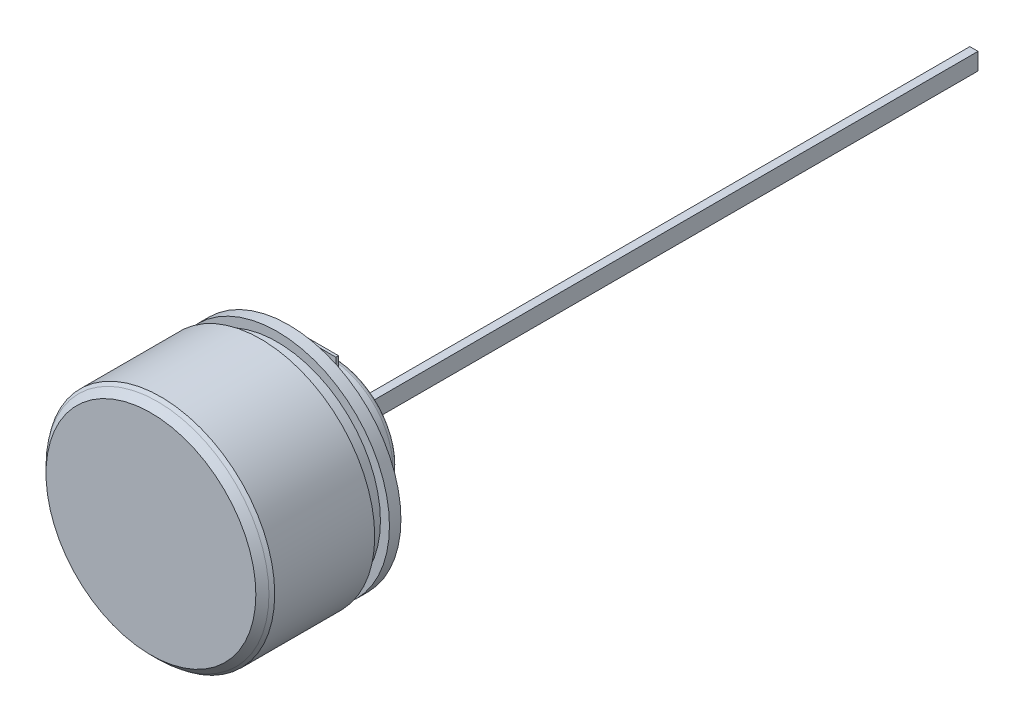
ISO-10303-21;
HEADER;
FILE_DESCRIPTION(('STEP AP214'),'2;1');
FILE_NAME('part.step','',(''),(''),'','','');
FILE_SCHEMA(('AUTOMOTIVE_DESIGN { 1 0 10303 214 1 1 1 1 }'));
ENDSEC;
DATA;
#1=APPLICATION_CONTEXT('core data for automotive mechanical design processes');
#2=APPLICATION_PROTOCOL_DEFINITION('international standard','automotive_design',2000,#1);
#3=PRODUCT_CONTEXT('',#1,'mechanical');
#4=PRODUCT('Part','Part','',(#3));
#5=PRODUCT_RELATED_PRODUCT_CATEGORY('part','',(#4));
#6=PRODUCT_DEFINITION_FORMATION('','',#4);
#7=PRODUCT_DEFINITION_CONTEXT('part definition',#1,'design');
#8=PRODUCT_DEFINITION('design','',#6,#7);
#9=PRODUCT_DEFINITION_SHAPE('','',#8);
#10=(LENGTH_UNIT() NAMED_UNIT(*) SI_UNIT(.MILLI.,.METRE.));
#11=(NAMED_UNIT(*) PLANE_ANGLE_UNIT() SI_UNIT($,.RADIAN.));
#12=(NAMED_UNIT(*) SI_UNIT($,.STERADIAN.) SOLID_ANGLE_UNIT());
#13=UNCERTAINTY_MEASURE_WITH_UNIT(LENGTH_MEASURE(1.E-05),#10,'distance_accuracy_value','');
#14=(GEOMETRIC_REPRESENTATION_CONTEXT(3) GLOBAL_UNCERTAINTY_ASSIGNED_CONTEXT((#13)) GLOBAL_UNIT_ASSIGNED_CONTEXT((#10,
#11,#12)) REPRESENTATION_CONTEXT('',''));
#15=CARTESIAN_POINT('',(0.,0.,0.));
#16=DIRECTION('',(0.,0.,1.));
#17=DIRECTION('',(1.,0.,0.));
#18=AXIS2_PLACEMENT_3D('',#15,#16,#17);
#19=CARTESIAN_POINT('',(0.,19.25,0.));
#20=DIRECTION('',(0.,0.,1.));
#21=DIRECTION('',(1.,0.,0.));
#22=AXIS2_PLACEMENT_3D('',#19,#20,#21);
#23=PLANE('',#22);
#24=CARTESIAN_POINT('',(0.,0.,0.));
#25=DIRECTION('',(0.,0.,1.));
#26=DIRECTION('',(1.,0.,0.));
#27=AXIS2_PLACEMENT_3D('',#24,#25,#26);
#28=CIRCLE('',#27,27.75);
#29=CARTESIAN_POINT('',(27.75,0.,0.));
#30=VERTEX_POINT('',#29);
#31=EDGE_CURVE('E215',#30,#30,#28,.T.);
#32=ORIENTED_EDGE('',*,*,#31,.F.);
#33=EDGE_LOOP('',(#32));
#34=FACE_BOUND('',#33,.T.);
#35=CARTESIAN_POINT('',(0.,0.,0.));
#36=DIRECTION('',(0.,0.,1.));
#37=DIRECTION('',(1.,0.,0.));
#38=AXIS2_PLACEMENT_3D('',#35,#36,#37);
#39=CIRCLE('',#38,19.25);
#40=CARTESIAN_POINT('',(19.25,0.,0.));
#41=VERTEX_POINT('',#40);
#42=EDGE_CURVE('E176',#41,#41,#39,.T.);
#43=ORIENTED_EDGE('',*,*,#42,.T.);
#44=EDGE_LOOP('',(#43));
#45=FACE_BOUND('',#44,.T.);
#46=ADVANCED_FACE('F14',(#34,#45),#23,.F.);
#47=CARTESIAN_POINT('',(0.,0.,52.587904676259));
#48=DIRECTION('',(0.,0.,1.));
#49=DIRECTION('',(1.,0.,0.));
#50=AXIS2_PLACEMENT_3D('',#47,#48,#49);
#51=CYLINDRICAL_SURFACE('',#50,27.75);
#52=ORIENTED_EDGE('',*,*,#31,.T.);
#53=EDGE_LOOP('',(#52));
#54=FACE_BOUND('',#53,.T.);
#55=CARTESIAN_POINT('',(0.,0.,3.));
#56=DIRECTION('',(0.,0.,1.));
#57=DIRECTION('',(1.,0.,0.));
#58=AXIS2_PLACEMENT_3D('',#55,#56,#57);
#59=CIRCLE('',#58,27.75);
#60=CARTESIAN_POINT('',(27.75,0.,3.));
#61=VERTEX_POINT('',#60);
#62=EDGE_CURVE('E212',#61,#61,#59,.T.);
#63=ORIENTED_EDGE('',*,*,#62,.F.);
#64=EDGE_LOOP('',(#63));
#65=FACE_BOUND('',#64,.T.);
#66=ADVANCED_FACE('F273',(#54,#65),#51,.T.);
#67=CARTESIAN_POINT('',(0.,27.75,3.));
#68=DIRECTION('',(0.,0.,1.));
#69=DIRECTION('',(1.,0.,0.));
#70=AXIS2_PLACEMENT_3D('',#67,#68,#69);
#71=PLANE('',#70);
#72=CARTESIAN_POINT('',(0.,0.,3.));
#73=DIRECTION('',(0.,0.,1.));
#74=DIRECTION('',(1.,0.,0.));
#75=AXIS2_PLACEMENT_3D('',#72,#73,#74);
#76=CIRCLE('',#75,34.25);
#77=CARTESIAN_POINT('',(34.25,0.,3.));
#78=VERTEX_POINT('',#77);
#79=EDGE_CURVE('E209',#78,#78,#76,.T.);
#80=ORIENTED_EDGE('',*,*,#79,.F.);
#81=EDGE_LOOP('',(#80));
#82=FACE_BOUND('',#81,.T.);
#83=ORIENTED_EDGE('',*,*,#62,.T.);
#84=EDGE_LOOP('',(#83));
#85=FACE_BOUND('',#84,.T.);
#86=ADVANCED_FACE('F279',(#82,#85),#71,.F.);
#87=CARTESIAN_POINT('',(0.,0.,52.587904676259));
#88=DIRECTION('',(0.,0.,1.));
#89=DIRECTION('',(1.,0.,0.));
#90=AXIS2_PLACEMENT_3D('',#87,#88,#89);
#91=CYLINDRICAL_SURFACE('',#90,34.25);
#92=CARTESIAN_POINT('',(0.,0.,6.5));
#93=DIRECTION('',(0.,0.,1.));
#94=DIRECTION('',(1.,0.,0.));
#95=AXIS2_PLACEMENT_3D('',#92,#93,#94);
#96=CIRCLE('',#95,34.25);
#97=CARTESIAN_POINT('',(34.25,0.,6.5));
#98=VERTEX_POINT('',#97);
#99=EDGE_CURVE('E206',#98,#98,#96,.T.);
#100=ORIENTED_EDGE('',*,*,#99,.F.);
#101=EDGE_LOOP('',(#100));
#102=FACE_BOUND('',#101,.T.);
#103=ORIENTED_EDGE('',*,*,#79,.T.);
#104=EDGE_LOOP('',(#103));
#105=FACE_BOUND('',#104,.T.);
#106=ADVANCED_FACE('F335',(#102,#105),#91,.T.);
#107=CARTESIAN_POINT('',(0.,31.5,6.50000000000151));
#108=DIRECTION('',(0.,0.,1.));
#109=DIRECTION('',(1.,0.,0.));
#110=AXIS2_PLACEMENT_3D('',#107,#108,#109);
#111=PLANE('',#110);
#112=ORIENTED_EDGE('',*,*,#99,.T.);
#113=EDGE_LOOP('',(#112));
#114=FACE_BOUND('',#113,.T.);
#115=CARTESIAN_POINT('',(0.,0.,6.50000000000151));
#116=DIRECTION('',(0.,0.,1.));
#117=DIRECTION('',(1.,0.,0.));
#118=AXIS2_PLACEMENT_3D('',#115,#116,#117);
#119=CIRCLE('',#118,31.5);
#120=CARTESIAN_POINT('',(31.5,0.,6.50000000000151));
#121=VERTEX_POINT('',#120);
#122=EDGE_CURVE('E203',#121,#121,#119,.T.);
#123=ORIENTED_EDGE('',*,*,#122,.F.);
#124=EDGE_LOOP('',(#123));
#125=FACE_BOUND('',#124,.T.);
#126=ADVANCED_FACE('F331',(#114,#125),#111,.T.);
#127=CARTESIAN_POINT('',(0.,0.,52.587904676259));
#128=DIRECTION('',(0.,0.,1.));
#129=DIRECTION('',(1.,0.,0.));
#130=AXIS2_PLACEMENT_3D('',#127,#128,#129);
#131=CYLINDRICAL_SURFACE('',#130,31.5);
#132=ORIENTED_EDGE('',*,*,#122,.T.);
#133=EDGE_LOOP('',(#132));
#134=FACE_BOUND('',#133,.T.);
#135=CARTESIAN_POINT('',(0.,0.,11.500000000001));
#136=DIRECTION('',(0.,0.,1.));
#137=DIRECTION('',(1.,0.,0.));
#138=AXIS2_PLACEMENT_3D('',#135,#136,#137);
#139=CIRCLE('',#138,31.5);
#140=CARTESIAN_POINT('',(31.5,0.,11.500000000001));
#141=VERTEX_POINT('',#140);
#142=EDGE_CURVE('E200',#141,#141,#139,.T.);
#143=ORIENTED_EDGE('',*,*,#142,.F.);
#144=EDGE_LOOP('',(#143));
#145=FACE_BOUND('',#144,.T.);
#146=ADVANCED_FACE('F327',(#134,#145),#131,.T.);
#147=CARTESIAN_POINT('',(0.,31.5,11.500000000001));
#148=DIRECTION('',(0.,0.,1.));
#149=DIRECTION('',(1.,0.,0.));
#150=AXIS2_PLACEMENT_3D('',#147,#148,#149);
#151=PLANE('',#150);
#152=CARTESIAN_POINT('',(0.,0.,11.500000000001));
#153=DIRECTION('',(0.,0.,1.));
#154=DIRECTION('',(1.,0.,0.));
#155=AXIS2_PLACEMENT_3D('',#152,#153,#154);
#156=CIRCLE('',#155,34.7547473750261);
#157=CARTESIAN_POINT('',(34.7547473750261,0.,11.500000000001));
#158=VERTEX_POINT('',#157);
#159=EDGE_CURVE('E197',#158,#158,#156,.T.);
#160=ORIENTED_EDGE('',*,*,#159,.F.);
#161=EDGE_LOOP('',(#160));
#162=FACE_BOUND('',#161,.T.);
#163=ORIENTED_EDGE('',*,*,#142,.T.);
#164=EDGE_LOOP('',(#163));
#165=FACE_BOUND('',#164,.T.);
#166=ADVANCED_FACE('F323',(#162,#165),#151,.F.);
#167=CARTESIAN_POINT('',(0.,0.,52.587904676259));
#168=DIRECTION('',(0.,0.,1.));
#169=DIRECTION('',(1.,0.,0.));
#170=AXIS2_PLACEMENT_3D('',#167,#168,#169);
#171=CYLINDRICAL_SURFACE('',#170,34.754747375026);
#172=ORIENTED_EDGE('',*,*,#159,.T.);
#173=EDGE_LOOP('',(#172));
#174=FACE_BOUND('',#173,.T.);
#175=CARTESIAN_POINT('',(0.,0.,42.0000000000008));
#176=DIRECTION('',(0.,0.,1.));
#177=DIRECTION('',(1.,0.,0.));
#178=AXIS2_PLACEMENT_3D('',#175,#176,#177);
#179=CIRCLE('',#178,34.7547473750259);
#180=CARTESIAN_POINT('',(34.7547473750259,0.,42.0000000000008));
#181=VERTEX_POINT('',#180);
#182=EDGE_CURVE('E194',#181,#181,#179,.T.);
#183=ORIENTED_EDGE('',*,*,#182,.F.);
#184=EDGE_LOOP('',(#183));
#185=FACE_BOUND('',#184,.T.);
#186=ADVANCED_FACE('F319',(#174,#185),#171,.T.);
#187=CARTESIAN_POINT('',(0.,0.,42.0000000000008));
#188=DIRECTION('',(0.,0.,-1.));
#189=DIRECTION('',(-1.,0.,0.));
#190=AXIS2_PLACEMENT_3D('',#187,#188,#189);
#191=CONICAL_SURFACE('',#190,34.7547473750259,0.773373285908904);
#192=CARTESIAN_POINT('',(0.,0.,43.));
#193=DIRECTION('',(0.,0.,1.));
#194=DIRECTION('',(1.,0.,0.));
#195=AXIS2_PLACEMENT_3D('',#192,#193,#194);
#196=CIRCLE('',#195,33.7785125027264);
#197=CARTESIAN_POINT('',(33.7785125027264,0.,43.));
#198=VERTEX_POINT('',#197);
#199=EDGE_CURVE('E191',#198,#198,#196,.T.);
#200=ORIENTED_EDGE('',*,*,#199,.F.);
#201=EDGE_LOOP('',(#200));
#202=FACE_BOUND('',#201,.T.);
#203=ORIENTED_EDGE('',*,*,#182,.T.);
#204=EDGE_LOOP('',(#203));
#205=FACE_BOUND('',#204,.T.);
#206=ADVANCED_FACE('F315',(#202,#205),#191,.T.);
#207=CARTESIAN_POINT('',(0.,34.,43.));
#208=DIRECTION('',(0.,0.,-1.));
#209=DIRECTION('',(-1.,0.,0.));
#210=AXIS2_PLACEMENT_3D('',#207,#208,#209);
#211=PLANE('',#210);
#212=ORIENTED_EDGE('',*,*,#199,.T.);
#213=EDGE_LOOP('',(#212));
#214=FACE_BOUND('',#213,.T.);
#215=CARTESIAN_POINT('',(0.,0.,43.));
#216=DIRECTION('',(0.,0.,1.));
#217=DIRECTION('',(1.,0.,0.));
#218=AXIS2_PLACEMENT_3D('',#215,#216,#217);
#219=CIRCLE('',#218,34.0000000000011);
#220=CARTESIAN_POINT('',(34.0000000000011,0.,43.));
#221=VERTEX_POINT('',#220);
#222=EDGE_CURVE('E188',#221,#221,#219,.T.);
#223=ORIENTED_EDGE('',*,*,#222,.F.);
#224=EDGE_LOOP('',(#223));
#225=FACE_BOUND('',#224,.T.);
#226=ADVANCED_FACE('F311',(#214,#225),#211,.T.);
#227=CARTESIAN_POINT('',(0.,0.,45.0000000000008));
#228=DIRECTION('',(0.,0.,-1.));
#229=DIRECTION('',(-1.,0.,0.));
#230=AXIS2_PLACEMENT_3D('',#227,#228,#229);
#231=CONICAL_SURFACE('',#230,32.,0.7853981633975);
#232=ORIENTED_EDGE('',*,*,#222,.T.);
#233=EDGE_LOOP('',(#232));
#234=FACE_BOUND('',#233,.T.);
#235=CARTESIAN_POINT('',(0.,0.,45.0000000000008));
#236=DIRECTION('',(0.,0.,1.));
#237=DIRECTION('',(1.,0.,0.));
#238=AXIS2_PLACEMENT_3D('',#235,#236,#237);
#239=CIRCLE('',#238,32.);
#240=CARTESIAN_POINT('',(32.,0.,45.0000000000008));
#241=VERTEX_POINT('',#240);
#242=EDGE_CURVE('E185',#241,#241,#239,.T.);
#243=ORIENTED_EDGE('',*,*,#242,.F.);
#244=EDGE_LOOP('',(#243));
#245=FACE_BOUND('',#244,.T.);
#246=ADVANCED_FACE('F305',(#234,#245),#231,.T.);
#247=CARTESIAN_POINT('',(0.,0.,45.0000000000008));
#248=DIRECTION('',(0.,0.,1.));
#249=DIRECTION('',(1.,0.,0.));
#250=AXIS2_PLACEMENT_3D('',#247,#248,#249);
#251=PLANE('',#250);
#252=ORIENTED_EDGE('',*,*,#242,.T.);
#253=EDGE_LOOP('',(#252));
#254=FACE_BOUND('',#253,.T.);
#255=ADVANCED_FACE('F299',(#254),#251,.T.);
#256=CARTESIAN_POINT('',(0.,0.,-11.));
#257=DIRECTION('',(0.,0.,1.));
#258=DIRECTION('',(1.,0.,0.));
#259=AXIS2_PLACEMENT_3D('',#256,#257,#258);
#260=PLANE('',#259);
#261=DIRECTION('',(-1.,0.,0.));
#262=VECTOR('',#261,1.);
#263=CARTESIAN_POINT('',(1.25,-2.6,-11.));
#264=LINE('',#263,#262);
#265=CARTESIAN_POINT('',(1.25,-2.6,-11.));
#266=VERTEX_POINT('',#265);
#267=CARTESIAN_POINT('',(-1.25,-2.6,-11.));
#268=VERTEX_POINT('',#267);
#269=EDGE_CURVE('E28',#266,#268,#264,.T.);
#270=ORIENTED_EDGE('',*,*,#269,.F.);
#271=DIRECTION('',(0.,-1.,0.));
#272=VECTOR('',#271,1.);
#273=CARTESIAN_POINT('',(1.25,2.6,-11.));
#274=LINE('',#273,#272);
#275=CARTESIAN_POINT('',(1.25,2.6,-11.));
#276=VERTEX_POINT('',#275);
#277=EDGE_CURVE('E33',#276,#266,#274,.T.);
#278=ORIENTED_EDGE('',*,*,#277,.F.);
#279=DIRECTION('',(-1.,0.,0.));
#280=VECTOR('',#279,1.);
#281=CARTESIAN_POINT('',(1.25,2.6,-11.));
#282=LINE('',#281,#280);
#283=CARTESIAN_POINT('',(-1.25,2.6,-11.));
#284=VERTEX_POINT('',#283);
#285=EDGE_CURVE('E136',#276,#284,#282,.T.);
#286=ORIENTED_EDGE('',*,*,#285,.T.);
#287=DIRECTION('',(0.,-1.,0.));
#288=VECTOR('',#287,1.);
#289=CARTESIAN_POINT('',(-1.25,2.6,-11.));
#290=LINE('',#289,#288);
#291=EDGE_CURVE('E107',#284,#268,#290,.T.);
#292=ORIENTED_EDGE('',*,*,#291,.T.);
#293=EDGE_LOOP('',(#270,#278,#286,#292));
#294=FACE_BOUND('',#293,.T.);
#295=CARTESIAN_POINT('',(0.,0.,-11.));
#296=DIRECTION('',(0.,0.,1.));
#297=DIRECTION('',(1.,0.,0.));
#298=AXIS2_PLACEMENT_3D('',#295,#296,#297);
#299=CIRCLE('',#298,17.75);
#300=CARTESIAN_POINT('',(17.75,0.,-11.));
#301=VERTEX_POINT('',#300);
#302=EDGE_CURVE('E182',#301,#301,#299,.T.);
#303=ORIENTED_EDGE('',*,*,#302,.F.);
#304=EDGE_LOOP('',(#303));
#305=FACE_BOUND('',#304,.T.);
#306=ADVANCED_FACE('F294',(#294,#305),#260,.F.);
#307=CARTESIAN_POINT('',(0.,0.,-9.5));
#308=DIRECTION('',(0.,0.,1.));
#309=DIRECTION('',(1.,0.,0.));
#310=AXIS2_PLACEMENT_3D('',#307,#308,#309);
#311=TOROIDAL_SURFACE('',#310,17.75,1.5);
#312=CARTESIAN_POINT('',(0.,0.,-9.5));
#313=DIRECTION('',(0.,0.,1.));
#314=DIRECTION('',(1.,0.,0.));
#315=AXIS2_PLACEMENT_3D('',#312,#313,#314);
#316=CIRCLE('',#315,19.25);
#317=CARTESIAN_POINT('',(19.25,0.,-9.5));
#318=VERTEX_POINT('',#317);
#319=EDGE_CURVE('E179',#318,#318,#316,.T.);
#320=ORIENTED_EDGE('',*,*,#319,.F.);
#321=EDGE_LOOP('',(#320));
#322=FACE_BOUND('',#321,.T.);
#323=ORIENTED_EDGE('',*,*,#302,.T.);
#324=EDGE_LOOP('',(#323));
#325=FACE_BOUND('',#324,.T.);
#326=ADVANCED_FACE('F288',(#322,#325),#311,.T.);
#327=CARTESIAN_POINT('',(0.,0.,52.587904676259));
#328=DIRECTION('',(0.,0.,1.));
#329=DIRECTION('',(1.,0.,0.));
#330=AXIS2_PLACEMENT_3D('',#327,#328,#329);
#331=CYLINDRICAL_SURFACE('',#330,19.25);
#332=CARTESIAN_POINT('',(0.,0.,-6.7));
#333=DIRECTION('',(0.,0.,1.));
#334=DIRECTION('',(1.,0.,0.));
#335=AXIS2_PLACEMENT_3D('',#332,#333,#334);
#336=CIRCLE('',#335,19.25);
#337=CARTESIAN_POINT('',(5.5,18.4475608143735,-6.7));
#338=VERTEX_POINT('',#337);
#339=CARTESIAN_POINT('',(-5.5,18.4475608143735,-6.7));
#340=VERTEX_POINT('',#339);
#341=EDGE_CURVE('E225',#338,#340,#336,.T.);
#342=ORIENTED_EDGE('',*,*,#341,.F.);
#343=DIRECTION('',(0.,0.,1.));
#344=VECTOR('',#343,1.);
#345=CARTESIAN_POINT('',(5.5,18.4475608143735,52.587904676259));
#346=LINE('',#345,#344);
#347=CARTESIAN_POINT('',(5.5,18.4475608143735,-5.9));
#348=VERTEX_POINT('',#347);
#349=EDGE_CURVE('E9',#338,#348,#346,.T.);
#350=ORIENTED_EDGE('',*,*,#349,.T.);
#351=CARTESIAN_POINT('',(0.,0.,-5.9));
#352=DIRECTION('',(0.,0.,1.));
#353=DIRECTION('',(1.,0.,0.));
#354=AXIS2_PLACEMENT_3D('',#351,#352,#353);
#355=CIRCLE('',#354,19.25);
#356=CARTESIAN_POINT('',(-5.5,18.4475608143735,-5.9));
#357=VERTEX_POINT('',#356);
#358=EDGE_CURVE('E21',#348,#357,#355,.T.);
#359=ORIENTED_EDGE('',*,*,#358,.T.);
#360=DIRECTION('',(0.,0.,1.));
#361=VECTOR('',#360,1.);
#362=CARTESIAN_POINT('',(-5.5,18.4475608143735,52.587904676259));
#363=LINE('',#362,#361);
#364=EDGE_CURVE('E228',#340,#357,#363,.T.);
#365=ORIENTED_EDGE('',*,*,#364,.F.);
#366=EDGE_LOOP('',(#342,#350,#359,#365));
#367=FACE_BOUND('',#366,.T.);
#368=CARTESIAN_POINT('',(-5.5,-18.4475608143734,-5.9));
#369=VERTEX_POINT('',#368);
#370=CARTESIAN_POINT('',(5.5,-18.4475608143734,-5.9));
#371=VERTEX_POINT('',#370);
#372=EDGE_CURVE('E224',#369,#371,#355,.T.);
#373=ORIENTED_EDGE('',*,*,#372,.T.);
#374=DIRECTION('',(0.,0.,1.));
#375=VECTOR('',#374,1.);
#376=CARTESIAN_POINT('',(5.5,-18.4475608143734,52.587904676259));
#377=LINE('',#376,#375);
#378=CARTESIAN_POINT('',(5.5,-18.4475608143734,-6.7));
#379=VERTEX_POINT('',#378);
#380=EDGE_CURVE('E227',#371,#379,#377,.F.);
#381=ORIENTED_EDGE('',*,*,#380,.T.);
#382=CARTESIAN_POINT('',(-5.5,-18.4475608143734,-6.7));
#383=VERTEX_POINT('',#382);
#384=EDGE_CURVE('E221',#383,#379,#336,.T.);
#385=ORIENTED_EDGE('',*,*,#384,.F.);
#386=DIRECTION('',(0.,0.,1.));
#387=VECTOR('',#386,1.);
#388=CARTESIAN_POINT('',(-5.5,-18.4475608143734,52.587904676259));
#389=LINE('',#388,#387);
#390=EDGE_CURVE('E218',#369,#383,#389,.F.);
#391=ORIENTED_EDGE('',*,*,#390,.F.);
#392=EDGE_LOOP('',(#373,#381,#385,#391));
#393=FACE_BOUND('',#392,.T.);
#394=ORIENTED_EDGE('',*,*,#42,.F.);
#395=EDGE_LOOP('',(#394));
#396=FACE_BOUND('',#395,.T.);
#397=ORIENTED_EDGE('',*,*,#319,.T.);
#398=EDGE_LOOP('',(#397));
#399=FACE_BOUND('',#398,.T.);
#400=ADVANCED_FACE('F238',(#367,#393,#396,#399),#331,.T.);
#401=CARTESIAN_POINT('',(5.5,-24.,-5.9));
#402=DIRECTION('',(0.,1.,0.));
#403=DIRECTION('',(1.,0.,0.));
#404=AXIS2_PLACEMENT_3D('',#401,#402,#403);
#405=PLANE('',#404);
#406=DIRECTION('',(-1.,0.,0.));
#407=VECTOR('',#406,1.);
#408=CARTESIAN_POINT('',(5.5,-24.,-6.7));
#409=LINE('',#408,#407);
#410=CARTESIAN_POINT('',(5.5,-24.,-6.7));
#411=VERTEX_POINT('',#410);
#412=CARTESIAN_POINT('',(-5.5,-24.,-6.7));
#413=VERTEX_POINT('',#412);
#414=EDGE_CURVE('E169',#411,#413,#409,.T.);
#415=ORIENTED_EDGE('',*,*,#414,.F.);
#416=DIRECTION('',(0.,0.,-1.));
#417=VECTOR('',#416,1.);
#418=CARTESIAN_POINT('',(5.5,-24.,-5.9));
#419=LINE('',#418,#417);
#420=CARTESIAN_POINT('',(5.5,-24.,-5.9));
#421=VERTEX_POINT('',#420);
#422=EDGE_CURVE('E159',#421,#411,#419,.T.);
#423=ORIENTED_EDGE('',*,*,#422,.F.);
#424=DIRECTION('',(-1.,0.,0.));
#425=VECTOR('',#424,1.);
#426=CARTESIAN_POINT('',(5.5,-24.,-5.9));
#427=LINE('',#426,#425);
#428=CARTESIAN_POINT('',(-5.5,-24.,-5.9));
#429=VERTEX_POINT('',#428);
#430=EDGE_CURVE('E171',#421,#429,#427,.T.);
#431=ORIENTED_EDGE('',*,*,#430,.T.);
#432=DIRECTION('',(0.,0.,-1.));
#433=VECTOR('',#432,1.);
#434=CARTESIAN_POINT('',(-5.5,-24.,-5.9));
#435=LINE('',#434,#433);
#436=EDGE_CURVE('E145',#429,#413,#435,.T.);
#437=ORIENTED_EDGE('',*,*,#436,.T.);
#438=EDGE_LOOP('',(#415,#423,#431,#437));
#439=FACE_BOUND('',#438,.T.);
#440=ADVANCED_FACE('F287',(#439),#405,.F.);
#441=CARTESIAN_POINT('',(5.5,24.,-6.7));
#442=DIRECTION('',(1.,0.,0.));
#443=DIRECTION('',(0.,0.,-1.));
#444=AXIS2_PLACEMENT_3D('',#441,#442,#443);
#445=PLANE('',#444);
#446=ORIENTED_EDGE('',*,*,#380,.F.);
#447=DIRECTION('',(0.,1.,0.));
#448=VECTOR('',#447,1.);
#449=CARTESIAN_POINT('',(5.5,-24.,-5.9));
#450=LINE('',#449,#448);
#451=EDGE_CURVE('E163',#421,#371,#450,.T.);
#452=ORIENTED_EDGE('',*,*,#451,.F.);
#453=ORIENTED_EDGE('',*,*,#422,.T.);
#454=DIRECTION('',(0.,1.,0.));
#455=VECTOR('',#454,1.);
#456=CARTESIAN_POINT('',(5.5,-24.,-6.7));
#457=LINE('',#456,#455);
#458=EDGE_CURVE('E156',#411,#379,#457,.T.);
#459=ORIENTED_EDGE('',*,*,#458,.T.);
#460=EDGE_LOOP('',(#446,#452,#453,#459));
#461=FACE_BOUND('',#460,.T.);
#462=ADVANCED_FACE('F264',(#461),#445,.T.);
#463=CARTESIAN_POINT('',(-5.5,24.,-6.7));
#464=DIRECTION('',(1.,0.,0.));
#465=DIRECTION('',(0.,0.,-1.));
#466=AXIS2_PLACEMENT_3D('',#463,#464,#465);
#467=PLANE('',#466);
#468=DIRECTION('',(0.,1.,0.));
#469=VECTOR('',#468,1.);
#470=CARTESIAN_POINT('',(-5.5,-24.,-5.9));
#471=LINE('',#470,#469);
#472=EDGE_CURVE('E149',#429,#369,#471,.T.);
#473=ORIENTED_EDGE('',*,*,#472,.T.);
#474=ORIENTED_EDGE('',*,*,#390,.T.);
#475=DIRECTION('',(0.,1.,0.));
#476=VECTOR('',#475,1.);
#477=CARTESIAN_POINT('',(-5.5,-24.,-6.7));
#478=LINE('',#477,#476);
#479=EDGE_CURVE('E142',#413,#383,#478,.T.);
#480=ORIENTED_EDGE('',*,*,#479,.F.);
#481=ORIENTED_EDGE('',*,*,#436,.F.);
#482=EDGE_LOOP('',(#473,#474,#480,#481));
#483=FACE_BOUND('',#482,.T.);
#484=ADVANCED_FACE('F270',(#483),#467,.F.);
#485=CARTESIAN_POINT('',(5.5,-24.,-6.7));
#486=DIRECTION('',(0.,0.,1.));
#487=DIRECTION('',(1.,0.,0.));
#488=AXIS2_PLACEMENT_3D('',#485,#486,#487);
#489=PLANE('',#488);
#490=ORIENTED_EDGE('',*,*,#479,.T.);
#491=ORIENTED_EDGE('',*,*,#384,.T.);
#492=ORIENTED_EDGE('',*,*,#458,.F.);
#493=ORIENTED_EDGE('',*,*,#414,.T.);
#494=EDGE_LOOP('',(#490,#491,#492,#493));
#495=FACE_BOUND('',#494,.T.);
#496=ADVANCED_FACE('F256',(#495),#489,.F.);
#497=CARTESIAN_POINT('',(5.5,-24.,-5.9));
#498=DIRECTION('',(0.,0.,1.));
#499=DIRECTION('',(1.,0.,0.));
#500=AXIS2_PLACEMENT_3D('',#497,#498,#499);
#501=PLANE('',#500);
#502=ORIENTED_EDGE('',*,*,#372,.F.);
#503=ORIENTED_EDGE('',*,*,#472,.F.);
#504=ORIENTED_EDGE('',*,*,#430,.F.);
#505=ORIENTED_EDGE('',*,*,#451,.T.);
#506=EDGE_LOOP('',(#502,#503,#504,#505));
#507=FACE_BOUND('',#506,.T.);
#508=ADVANCED_FACE('F265',(#507),#501,.T.);
#509=ORIENTED_EDGE('',*,*,#358,.F.);
#510=CARTESIAN_POINT('',(5.5,24.,-5.9));
#511=VERTEX_POINT('',#510);
#512=EDGE_CURVE('E162',#348,#511,#450,.T.);
#513=ORIENTED_EDGE('',*,*,#512,.T.);
#514=DIRECTION('',(-1.,0.,0.));
#515=VECTOR('',#514,1.);
#516=CARTESIAN_POINT('',(5.5,24.,-5.9));
#517=LINE('',#516,#515);
#518=CARTESIAN_POINT('',(-5.5,24.,-5.9));
#519=VERTEX_POINT('',#518);
#520=EDGE_CURVE('E173',#511,#519,#517,.T.);
#521=ORIENTED_EDGE('',*,*,#520,.T.);
#522=EDGE_CURVE('E148',#357,#519,#471,.T.);
#523=ORIENTED_EDGE('',*,*,#522,.F.);
#524=EDGE_LOOP('',(#509,#513,#521,#523));
#525=FACE_BOUND('',#524,.T.);
#526=ADVANCED_FACE('F243',(#525),#501,.T.);
#527=CARTESIAN_POINT('',(5.5,24.,-6.7));
#528=VERTEX_POINT('',#527);
#529=EDGE_CURVE('E155',#338,#528,#457,.T.);
#530=ORIENTED_EDGE('',*,*,#529,.F.);
#531=ORIENTED_EDGE('',*,*,#341,.T.);
#532=CARTESIAN_POINT('',(-5.5,24.,-6.7));
#533=VERTEX_POINT('',#532);
#534=EDGE_CURVE('E141',#340,#533,#478,.T.);
#535=ORIENTED_EDGE('',*,*,#534,.T.);
#536=DIRECTION('',(-1.,0.,0.));
#537=VECTOR('',#536,1.);
#538=CARTESIAN_POINT('',(5.5,24.,-6.7));
#539=LINE('',#538,#537);
#540=EDGE_CURVE('E166',#528,#533,#539,.T.);
#541=ORIENTED_EDGE('',*,*,#540,.F.);
#542=EDGE_LOOP('',(#530,#531,#535,#541));
#543=FACE_BOUND('',#542,.T.);
#544=ADVANCED_FACE('F253',(#543),#489,.F.);
#545=ORIENTED_EDGE('',*,*,#349,.F.);
#546=ORIENTED_EDGE('',*,*,#529,.T.);
#547=DIRECTION('',(0.,0.,-1.));
#548=VECTOR('',#547,1.);
#549=CARTESIAN_POINT('',(5.5,24.,-5.9));
#550=LINE('',#549,#548);
#551=EDGE_CURVE('E152',#511,#528,#550,.T.);
#552=ORIENTED_EDGE('',*,*,#551,.F.);
#553=ORIENTED_EDGE('',*,*,#512,.F.);
#554=EDGE_LOOP('',(#545,#546,#552,#553));
#555=FACE_BOUND('',#554,.T.);
#556=ADVANCED_FACE('F247',(#555),#445,.T.);
#557=ORIENTED_EDGE('',*,*,#534,.F.);
#558=ORIENTED_EDGE('',*,*,#364,.T.);
#559=ORIENTED_EDGE('',*,*,#522,.T.);
#560=DIRECTION('',(0.,0.,-1.));
#561=VECTOR('',#560,1.);
#562=CARTESIAN_POINT('',(-5.5,24.,-5.9));
#563=LINE('',#562,#561);
#564=EDGE_CURVE('E138',#519,#533,#563,.T.);
#565=ORIENTED_EDGE('',*,*,#564,.T.);
#566=EDGE_LOOP('',(#557,#558,#559,#565));
#567=FACE_BOUND('',#566,.T.);
#568=ADVANCED_FACE('F252',(#567),#467,.F.);
#569=CARTESIAN_POINT('',(5.5,24.,-5.9));
#570=DIRECTION('',(0.,1.,0.));
#571=DIRECTION('',(1.,0.,0.));
#572=AXIS2_PLACEMENT_3D('',#569,#570,#571);
#573=PLANE('',#572);
#574=ORIENTED_EDGE('',*,*,#520,.F.);
#575=ORIENTED_EDGE('',*,*,#551,.T.);
#576=ORIENTED_EDGE('',*,*,#540,.T.);
#577=ORIENTED_EDGE('',*,*,#564,.F.);
#578=EDGE_LOOP('',(#574,#575,#576,#577));
#579=FACE_BOUND('',#578,.T.);
#580=ADVANCED_FACE('F250',(#579),#573,.T.);
#581=CARTESIAN_POINT('',(1.25,-2.6,-11.));
#582=DIRECTION('',(0.,1.,0.));
#583=DIRECTION('',(0.,0.,1.));
#584=AXIS2_PLACEMENT_3D('',#581,#582,#583);
#585=PLANE('',#584);
#586=DIRECTION('',(0.,0.,-1.));
#587=VECTOR('',#586,1.);
#588=CARTESIAN_POINT('',(-1.25,-2.6,-11.));
#589=LINE('',#588,#587);
#590=CARTESIAN_POINT('',(-1.25,-2.6,-206.));
#591=VERTEX_POINT('',#590);
#592=EDGE_CURVE('E109',#268,#591,#589,.T.);
#593=ORIENTED_EDGE('',*,*,#592,.T.);
#594=DIRECTION('',(-1.,0.,0.));
#595=VECTOR('',#594,1.);
#596=CARTESIAN_POINT('',(1.25,-2.6,-206.));
#597=LINE('',#596,#595);
#598=CARTESIAN_POINT('',(1.25,-2.6,-206.));
#599=VERTEX_POINT('',#598);
#600=EDGE_CURVE('E124',#599,#591,#597,.T.);
#601=ORIENTED_EDGE('',*,*,#600,.F.);
#602=DIRECTION('',(0.,0.,-1.));
#603=VECTOR('',#602,1.);
#604=CARTESIAN_POINT('',(1.25,-2.6,-11.));
#605=LINE('',#604,#603);
#606=EDGE_CURVE('E131',#266,#599,#605,.T.);
#607=ORIENTED_EDGE('',*,*,#606,.F.);
#608=ORIENTED_EDGE('',*,*,#269,.T.);
#609=EDGE_LOOP('',(#593,#601,#607,#608));
#610=FACE_BOUND('',#609,.T.);
#611=ADVANCED_FACE('F470',(#610),#585,.F.);
#612=CARTESIAN_POINT('',(1.25,2.6,-11.));
#613=DIRECTION('',(0.,1.,0.));
#614=DIRECTION('',(1.,0.,0.));
#615=AXIS2_PLACEMENT_3D('',#612,#613,#614);
#616=PLANE('',#615);
#617=ORIENTED_EDGE('',*,*,#285,.F.);
#618=DIRECTION('',(0.,0.,-1.));
#619=VECTOR('',#618,1.);
#620=CARTESIAN_POINT('',(1.25,2.6,-11.));
#621=LINE('',#620,#619);
#622=CARTESIAN_POINT('',(1.25,2.6,-206.));
#623=VERTEX_POINT('',#622);
#624=EDGE_CURVE('E115',#276,#623,#621,.T.);
#625=ORIENTED_EDGE('',*,*,#624,.T.);
#626=DIRECTION('',(1.,0.,0.));
#627=VECTOR('',#626,1.);
#628=CARTESIAN_POINT('',(-1.25,2.6,-206.));
#629=LINE('',#628,#627);
#630=CARTESIAN_POINT('',(-1.25,2.6,-206.));
#631=VERTEX_POINT('',#630);
#632=EDGE_CURVE('E112',#631,#623,#629,.T.);
#633=ORIENTED_EDGE('',*,*,#632,.F.);
#634=DIRECTION('',(0.,0.,-1.));
#635=VECTOR('',#634,1.);
#636=CARTESIAN_POINT('',(-1.25,2.6,-11.));
#637=LINE('',#636,#635);
#638=EDGE_CURVE('E101',#284,#631,#637,.T.);
#639=ORIENTED_EDGE('',*,*,#638,.F.);
#640=EDGE_LOOP('',(#617,#625,#633,#639));
#641=FACE_BOUND('',#640,.T.);
#642=ADVANCED_FACE('F113',(#641),#616,.T.);
#643=CARTESIAN_POINT('',(1.25,-2.6,-187.));
#644=DIRECTION('',(1.,0.,0.));
#645=DIRECTION('',(0.,0.,-1.));
#646=AXIS2_PLACEMENT_3D('',#643,#644,#645);
#647=PLANE('',#646);
#648=ORIENTED_EDGE('',*,*,#606,.T.);
#649=DIRECTION('',(0.,-1.,0.));
#650=VECTOR('',#649,1.);
#651=CARTESIAN_POINT('',(1.25,2.6,-206.));
#652=LINE('',#651,#650);
#653=EDGE_CURVE('E119',#623,#599,#652,.T.);
#654=ORIENTED_EDGE('',*,*,#653,.F.);
#655=ORIENTED_EDGE('',*,*,#624,.F.);
#656=ORIENTED_EDGE('',*,*,#277,.T.);
#657=EDGE_LOOP('',(#648,#654,#655,#656));
#658=FACE_BOUND('',#657,.T.);
#659=ADVANCED_FACE('F485',(#658),#647,.T.);
#660=CARTESIAN_POINT('',(-1.25,-2.6,-187.));
#661=DIRECTION('',(1.,0.,0.));
#662=DIRECTION('',(0.,0.,-1.));
#663=AXIS2_PLACEMENT_3D('',#660,#661,#662);
#664=PLANE('',#663);
#665=ORIENTED_EDGE('',*,*,#592,.F.);
#666=ORIENTED_EDGE('',*,*,#291,.F.);
#667=ORIENTED_EDGE('',*,*,#638,.T.);
#668=DIRECTION('',(0.,1.,0.));
#669=VECTOR('',#668,1.);
#670=CARTESIAN_POINT('',(-1.25,-2.6,-206.));
#671=LINE('',#670,#669);
#672=EDGE_CURVE('E106',#591,#631,#671,.T.);
#673=ORIENTED_EDGE('',*,*,#672,.F.);
#674=EDGE_LOOP('',(#665,#666,#667,#673));
#675=FACE_BOUND('',#674,.T.);
#676=ADVANCED_FACE('F104',(#675),#664,.F.);
#677=CARTESIAN_POINT('',(-1.25,2.6,-206.));
#678=DIRECTION('',(0.,0.,-1.));
#679=DIRECTION('',(-1.,0.,0.));
#680=AXIS2_PLACEMENT_3D('',#677,#678,#679);
#681=PLANE('',#680);
#682=ORIENTED_EDGE('',*,*,#672,.T.);
#683=ORIENTED_EDGE('',*,*,#632,.T.);
#684=ORIENTED_EDGE('',*,*,#653,.T.);
#685=ORIENTED_EDGE('',*,*,#600,.T.);
#686=EDGE_LOOP('',(#682,#683,#684,#685));
#687=FACE_BOUND('',#686,.T.);
#688=ADVANCED_FACE('F122',(#687),#681,.T.);
#689=CLOSED_SHELL('',(#46,#66,#86,#106,#126,#146,#166,#186,#206,#226,#246,#255,#306,#326,#400,
#440,#462,#484,#496,#508,#526,#544,#556,#568,#580,#611,#642,#659,#676,#688));
#690=MANIFOLD_SOLID_BREP('B1',#689);
#691=ADVANCED_BREP_SHAPE_REPRESENTATION('',(#18,#690),#14);
#692=SHAPE_DEFINITION_REPRESENTATION(#9,#691);
ENDSEC;
END-ISO-10303-21;
